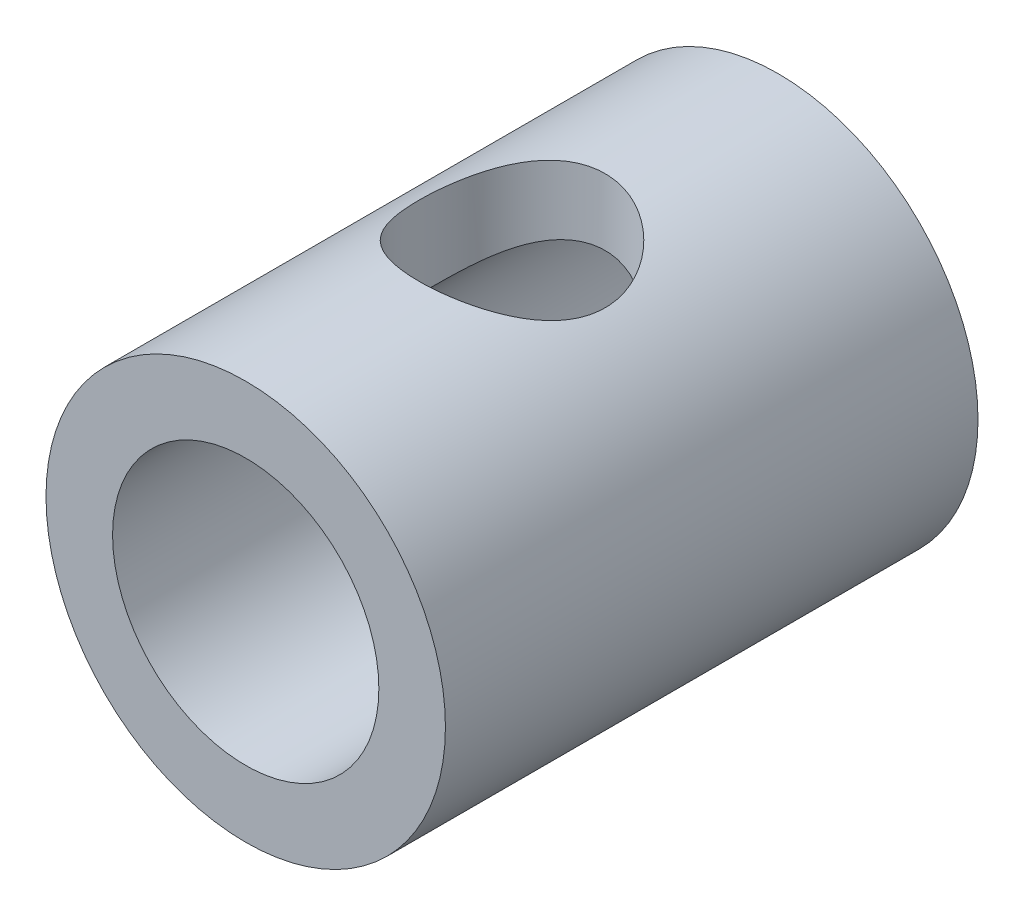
ISO-10303-21;
HEADER;
FILE_DESCRIPTION(('STEP AP214'),'2;1');
FILE_NAME('part.step','',(''),(''),'','','');
FILE_SCHEMA(('AUTOMOTIVE_DESIGN { 1 0 10303 214 1 1 1 1 }'));
ENDSEC;
DATA;
#1=APPLICATION_CONTEXT('core data for automotive mechanical design processes');
#2=APPLICATION_PROTOCOL_DEFINITION('international standard','automotive_design',2000,#1);
#3=PRODUCT_CONTEXT('',#1,'mechanical');
#4=PRODUCT('Part','Part','',(#3));
#5=PRODUCT_RELATED_PRODUCT_CATEGORY('part','',(#4));
#6=PRODUCT_DEFINITION_FORMATION('','',#4);
#7=PRODUCT_DEFINITION_CONTEXT('part definition',#1,'design');
#8=PRODUCT_DEFINITION('design','',#6,#7);
#9=PRODUCT_DEFINITION_SHAPE('','',#8);
#10=(LENGTH_UNIT() NAMED_UNIT(*) SI_UNIT(.MILLI.,.METRE.));
#11=(NAMED_UNIT(*) PLANE_ANGLE_UNIT() SI_UNIT($,.RADIAN.));
#12=(NAMED_UNIT(*) SI_UNIT($,.STERADIAN.) SOLID_ANGLE_UNIT());
#13=UNCERTAINTY_MEASURE_WITH_UNIT(LENGTH_MEASURE(1.E-05),#10,'distance_accuracy_value','');
#14=(GEOMETRIC_REPRESENTATION_CONTEXT(3) GLOBAL_UNCERTAINTY_ASSIGNED_CONTEXT((#13)) GLOBAL_UNIT_ASSIGNED_CONTEXT((#10,
#11,#12)) REPRESENTATION_CONTEXT('',''));
#15=CARTESIAN_POINT('',(0.,0.,0.));
#16=DIRECTION('',(0.,0.,1.));
#17=DIRECTION('',(1.,0.,0.));
#18=AXIS2_PLACEMENT_3D('',#15,#16,#17);
#19=CARTESIAN_POINT('',(0.,0.,40.));
#20=DIRECTION('',(0.,0.,-1.));
#21=DIRECTION('',(-1.,0.,0.));
#22=AXIS2_PLACEMENT_3D('',#19,#20,#21);
#23=CYLINDRICAL_SURFACE('',#22,15.);
#24=CARTESIAN_POINT('',(0.,-15.,27.));
#25=CARTESIAN_POINT('',(0.185527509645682,-14.9999989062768,26.9999987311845));
#26=CARTESIAN_POINT('',(0.37108915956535,-14.9965492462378,26.9926149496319));
#27=CARTESIAN_POINT('',(0.740864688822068,-14.9828363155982,26.963156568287));
#28=CARTESIAN_POINT('',(0.925077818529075,-14.9725695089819,26.9410743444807));
#29=CARTESIAN_POINT('',(1.29101586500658,-14.9454673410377,26.8824175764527));
#30=CARTESIAN_POINT('',(1.47273599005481,-14.928620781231,26.8458183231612));
#31=CARTESIAN_POINT('',(1.8321376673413,-14.8887870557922,26.7585122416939));
#32=CARTESIAN_POINT('',(2.00981753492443,-14.8657973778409,26.7077996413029));
#33=CARTESIAN_POINT('',(2.35915888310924,-14.8143651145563,26.5930291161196));
#34=CARTESIAN_POINT('',(2.53084229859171,-14.7859455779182,26.5290275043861));
#35=CARTESIAN_POINT('',(2.86799253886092,-14.7242659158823,26.3881154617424));
#36=CARTESIAN_POINT('',(3.03345697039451,-14.6910039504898,26.3112001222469));
#37=CARTESIAN_POINT('',(3.35710712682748,-14.6204390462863,26.1451512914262));
#38=CARTESIAN_POINT('',(3.51529725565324,-14.5831385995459,26.0560253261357));
#39=CARTESIAN_POINT('',(3.82374236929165,-14.5053212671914,25.8661597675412));
#40=CARTESIAN_POINT('',(3.97399442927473,-14.4648032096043,25.7654159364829));
#41=CARTESIAN_POINT('',(4.42760170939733,-14.3352174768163,25.4351670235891));
#42=CARTESIAN_POINT('',(4.71623752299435,-14.2420761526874,25.1866208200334));
#43=CARTESIAN_POINT('',(5.24943713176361,-14.0543075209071,24.6462489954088));
#44=CARTESIAN_POINT('',(5.49397191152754,-13.9596792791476,24.3543951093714));
#45=CARTESIAN_POINT('',(5.83075411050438,-13.8209401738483,23.8785879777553));
#46=CARTESIAN_POINT('',(5.94080662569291,-13.7738664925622,23.7078579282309));
#47=CARTESIAN_POINT('',(6.14601851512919,-13.6835306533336,23.3567480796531));
#48=CARTESIAN_POINT('',(6.2411840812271,-13.640266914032,23.1763723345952));
#49=CARTESIAN_POINT('',(6.41576799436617,-13.5590265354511,22.8070684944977));
#50=CARTESIAN_POINT('',(6.4951904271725,-13.5210485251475,22.6181426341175));
#51=CARTESIAN_POINT('',(6.63747055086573,-13.4517751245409,22.2329619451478));
#52=CARTESIAN_POINT('',(6.70032982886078,-13.4204790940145,22.0367078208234));
#53=CARTESIAN_POINT('',(6.80567082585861,-13.3673531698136,21.6494932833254));
#54=CARTESIAN_POINT('',(6.84909352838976,-13.3450926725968,21.4588480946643));
#55=CARTESIAN_POINT('',(6.91991023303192,-13.308509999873,21.0738452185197));
#56=CARTESIAN_POINT('',(6.94730483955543,-13.2941875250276,20.8794876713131));
#57=CARTESIAN_POINT('',(6.98566539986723,-13.2740706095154,20.4888472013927));
#58=CARTESIAN_POINT('',(6.9966423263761,-13.268270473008,20.2925656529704));
#59=CARTESIAN_POINT('',(7.00203713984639,-13.2654245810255,19.8997185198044));
#60=CARTESIAN_POINT('',(6.99645627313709,-13.2683781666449,19.703152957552));
#61=CARTESIAN_POINT('',(6.97022504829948,-13.2821739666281,19.3313397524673));
#62=CARTESIAN_POINT('',(6.95115599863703,-13.2921880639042,19.1559468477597));
#63=CARTESIAN_POINT('',(6.89993033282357,-13.3188511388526,18.8075346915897));
#64=CARTESIAN_POINT('',(6.86776931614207,-13.3355023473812,18.6345162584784));
#65=CARTESIAN_POINT('',(6.79071696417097,-13.3749029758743,18.2920894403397));
#66=CARTESIAN_POINT('',(6.74582796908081,-13.3976512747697,18.1226803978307));
#67=CARTESIAN_POINT('',(6.64374391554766,-13.4485656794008,17.788387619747));
#68=CARTESIAN_POINT('',(6.58654406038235,-13.476733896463,17.6235056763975));
#69=CARTESIAN_POINT('',(6.45890740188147,-13.5383766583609,17.2955287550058));
#70=CARTESIAN_POINT('',(6.38820027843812,-13.5719568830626,17.1325587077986));
#71=CARTESIAN_POINT('',(6.23500689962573,-13.6430140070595,16.8131336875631));
#72=CARTESIAN_POINT('',(6.15251670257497,-13.6804922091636,16.656680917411));
#73=CARTESIAN_POINT('',(5.88811674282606,-13.7973596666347,16.1981069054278));
#74=CARTESIAN_POINT('',(5.68921430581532,-13.8812136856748,15.9066084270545));
#75=CARTESIAN_POINT('',(5.34868196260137,-14.0145878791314,15.4800831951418));
#76=CARTESIAN_POINT('',(5.22097547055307,-14.062774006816,15.333169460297));
#77=CARTESIAN_POINT('',(4.95377039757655,-14.1591066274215,15.0504618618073));
#78=CARTESIAN_POINT('',(4.8142749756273,-14.2072531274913,14.9146650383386));
#79=CARTESIAN_POINT('',(4.52411760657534,-14.3022965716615,14.6548784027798));
#80=CARTESIAN_POINT('',(4.37344759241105,-14.3491925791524,14.5308972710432));
#81=CARTESIAN_POINT('',(4.06185463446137,-14.4404874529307,14.2956665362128));
#82=CARTESIAN_POINT('',(3.90093579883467,-14.4848873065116,14.1844118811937));
#83=CARTESIAN_POINT('',(3.5636444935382,-14.5716107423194,13.9715984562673));
#84=CARTESIAN_POINT('',(3.38692345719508,-14.6138009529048,13.8705365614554));
#85=CARTESIAN_POINT('',(3.02450952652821,-14.6930843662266,13.6838406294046));
#86=CARTESIAN_POINT('',(2.83882065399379,-14.7301798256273,13.5981997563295));
#87=CARTESIAN_POINT('',(2.45973540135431,-14.7982015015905,13.4432006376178));
#88=CARTESIAN_POINT('',(2.26634150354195,-14.8291296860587,13.3738371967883));
#89=CARTESIAN_POINT('',(1.87328306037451,-14.8838894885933,13.2521765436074));
#90=CARTESIAN_POINT('',(1.67361913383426,-14.9077218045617,13.1998776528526));
#91=CARTESIAN_POINT('',(1.2849064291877,-14.9460444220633,13.1162863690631));
#92=CARTESIAN_POINT('',(1.09618911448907,-14.9611026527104,13.0837096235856));
#93=CARTESIAN_POINT('',(0.716291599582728,-14.9840958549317,13.0341106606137));
#94=CARTESIAN_POINT('',(0.525111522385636,-14.9920311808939,13.0170876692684));
#95=CARTESIAN_POINT('',(0.141899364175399,-15.0005528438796,12.9988107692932));
#96=CARTESIAN_POINT('',(-0.0501324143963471,-15.0011416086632,12.9975516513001));
#97=CARTESIAN_POINT('',(-0.433528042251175,-14.9949593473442,13.0108053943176));
#98=CARTESIAN_POINT('',(-0.624891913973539,-14.9881885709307,13.0253177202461));
#99=CARTESIAN_POINT('',(-0.992870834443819,-14.9681629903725,13.0684606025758));
#100=CARTESIAN_POINT('',(-1.16962816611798,-14.9553639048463,13.096099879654));
#101=CARTESIAN_POINT('',(-1.52005950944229,-14.9238191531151,13.1647014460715));
#102=CARTESIAN_POINT('',(-1.69373244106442,-14.9050714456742,13.2056683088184));
#103=CARTESIAN_POINT('',(-2.03675771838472,-14.8620823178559,13.3005018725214));
#104=CARTESIAN_POINT('',(-2.20611137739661,-14.8378425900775,13.3543645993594));
#105=CARTESIAN_POINT('',(-2.53960724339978,-14.7844151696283,13.474524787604));
#106=CARTESIAN_POINT('',(-2.70374743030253,-14.7552255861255,13.5408270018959));
#107=CARTESIAN_POINT('',(-3.03073676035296,-14.6916030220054,13.6874965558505));
#108=CARTESIAN_POINT('',(-3.193396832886,-14.6570381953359,13.7682285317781));
#109=CARTESIAN_POINT('',(-3.51134517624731,-14.584138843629,13.9416764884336));
#110=CARTESIAN_POINT('',(-3.66663071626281,-14.5458029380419,14.0343968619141));
#111=CARTESIAN_POINT('',(-4.12023182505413,-14.4264075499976,14.3295730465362));
#112=CARTESIAN_POINT('',(-4.40646643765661,-14.3409250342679,14.5491227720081));
#113=CARTESIAN_POINT('',(-4.9647193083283,-14.1578733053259,15.0498257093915));
#114=CARTESIAN_POINT('',(-5.23328196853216,-14.0599018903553,15.3346955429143));
#115=CARTESIAN_POINT('',(-5.59821974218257,-13.9167925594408,15.7930755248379));
#116=CARTESIAN_POINT('',(-5.71362151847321,-13.8696962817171,15.9511805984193));
#117=CARTESIAN_POINT('',(-5.93107342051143,-13.7781079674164,16.2770062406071));
#118=CARTESIAN_POINT('',(-6.03312871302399,-13.733614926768,16.4447230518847));
#119=CARTESIAN_POINT('',(-6.22628880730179,-13.6471574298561,16.7946020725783));
#120=CARTESIAN_POINT('',(-6.31692040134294,-13.605325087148,16.9770584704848));
#121=CARTESIAN_POINT('',(-6.48226486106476,-13.5273278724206,17.3501241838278));
#122=CARTESIAN_POINT('',(-6.55698529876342,-13.4911603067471,17.540729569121));
#123=CARTESIAN_POINT('',(-6.68967957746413,-13.4258579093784,17.9287219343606));
#124=CARTESIAN_POINT('',(-6.74766458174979,-13.3967183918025,18.1261042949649));
#125=CARTESIAN_POINT('',(-6.84618962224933,-13.3466383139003,18.5261908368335));
#126=CARTESIAN_POINT('',(-6.88673191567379,-13.3256966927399,18.7288943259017));
#127=CARTESIAN_POINT('',(-6.94693568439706,-13.2944019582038,19.119365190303));
#128=CARTESIAN_POINT('',(-6.96815027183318,-13.2832643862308,19.3068313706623));
#129=CARTESIAN_POINT('',(-6.99536983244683,-13.2689503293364,19.6831655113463));
#130=CARTESIAN_POINT('',(-7.00137576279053,-13.2657733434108,19.8720333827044));
#131=CARTESIAN_POINT('',(-6.99809627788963,-13.2675035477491,20.2495502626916));
#132=CARTESIAN_POINT('',(-6.98881457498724,-13.2724087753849,20.4381993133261));
#133=CARTESIAN_POINT('',(-6.95509456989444,-13.290109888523,20.8137582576));
#134=CARTESIAN_POINT('',(-6.93065662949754,-13.3029055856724,21.0006681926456));
#135=CARTESIAN_POINT('',(-6.8692843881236,-13.3346925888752,21.3576820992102));
#136=CARTESIAN_POINT('',(-6.83339644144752,-13.3531614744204,21.5280143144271));
#137=CARTESIAN_POINT('',(-6.7492425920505,-13.3958930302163,21.8649072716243));
#138=CARTESIAN_POINT('',(-6.70097250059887,-13.4201576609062,22.0314667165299));
#139=CARTESIAN_POINT('',(-6.59251960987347,-13.4737648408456,22.3597822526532));
#140=CARTESIAN_POINT('',(-6.53233858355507,-13.5031066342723,22.5215390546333));
#141=CARTESIAN_POINT('',(-6.40052875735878,-13.566081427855,22.839518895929));
#142=CARTESIAN_POINT('',(-6.32889554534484,-13.5997160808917,22.9957397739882));
#143=CARTESIAN_POINT('',(-6.16962215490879,-13.6727441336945,23.3119684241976));
#144=CARTESIAN_POINT('',(-6.0812384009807,-13.7123709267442,23.4715478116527));
#145=CARTESIAN_POINT('',(-5.89263773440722,-13.7944698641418,23.7828501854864));
#146=CARTESIAN_POINT('',(-5.7924167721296,-13.8369429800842,23.9345704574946));
#147=CARTESIAN_POINT('',(-5.58073172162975,-13.9236674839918,24.2294661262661));
#148=CARTESIAN_POINT('',(-5.46926511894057,-13.9679192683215,24.3726396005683));
#149=CARTESIAN_POINT('',(-5.23568066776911,-14.0571433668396,24.6497844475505));
#150=CARTESIAN_POINT('',(-5.11356215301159,-14.1021157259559,24.7837552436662));
#151=CARTESIAN_POINT('',(-4.84643680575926,-14.1962694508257,25.0548804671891));
#152=CARTESIAN_POINT('',(-4.7003634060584,-14.2454187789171,25.1909977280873));
#153=CARTESIAN_POINT('',(-4.3968457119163,-14.3420047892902,25.4504676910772));
#154=CARTESIAN_POINT('',(-4.23940499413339,-14.3894420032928,25.5738243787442));
#155=CARTESIAN_POINT('',(-3.91380631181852,-14.4813935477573,25.8070870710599));
#156=CARTESIAN_POINT('',(-3.74563849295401,-14.525905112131,25.916980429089));
#157=CARTESIAN_POINT('',(-3.39976003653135,-14.6107261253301,26.1222587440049));
#158=CARTESIAN_POINT('',(-3.22205385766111,-14.6510375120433,26.2176504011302));
#159=CARTESIAN_POINT('',(-2.85900975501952,-14.7261758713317,26.3926892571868));
#160=CARTESIAN_POINT('',(-2.67371235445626,-14.7610281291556,26.4724095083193));
#161=CARTESIAN_POINT('',(-2.29606194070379,-14.8244639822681,26.615804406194));
#162=CARTESIAN_POINT('',(-2.1037124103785,-14.853050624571,26.6794868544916));
#163=CARTESIAN_POINT('',(-1.71380885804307,-14.9030669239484,26.7899797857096));
#164=CARTESIAN_POINT('',(-1.51626804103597,-14.9245131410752,26.8368293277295));
#165=CARTESIAN_POINT('',(-1.11729196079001,-14.9596693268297,26.9132383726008));
#166=CARTESIAN_POINT('',(-0.915859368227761,-14.9733844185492,26.9428093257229));
#167=CARTESIAN_POINT('',(-0.594975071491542,-14.9886652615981,26.9756855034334));
#168=CARTESIAN_POINT('',(-0.476212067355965,-14.9929110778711,26.9847985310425));
#169=CARTESIAN_POINT('',(-0.238304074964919,-14.9985788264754,26.9969562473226));
#170=CARTESIAN_POINT('',(-0.119159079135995,-15.0000007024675,27.0000008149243));
#171=CARTESIAN_POINT('',(0.,-15.,27.));
#172=B_SPLINE_CURVE_WITH_KNOTS('',3,(#24,#25,#26,#27,#28,#29,#30,#31,#32,#33,#34,#35,#36,#37,
#38,#39,#40,#41,#42,#43,#44,#45,#46,#47,#48,#49,#50,#51,#52,#53,#54,#55,#56,#57,#58,#59,#60,#61,
#62,#63,#64,#65,#66,#67,#68,#69,#70,#71,#72,#73,#74,#75,#76,#77,#78,#79,#80,#81,#82,#83,#84,#85,
#86,#87,#88,#89,#90,#91,#92,#93,#94,#95,#96,#97,#98,#99,#100,#101,#102,#103,#104,#105,#106,#107,
#108,#109,#110,#111,#112,#113,#114,#115,#116,#117,#118,#119,#120,#121,#122,#123,#124,#125,#126,
#127,#128,#129,#130,#131,#132,#133,#134,#135,#136,#137,#138,#139,#140,#141,#142,#143,#144,#145,
#146,#147,#148,#149,#150,#151,#152,#153,#154,#155,#156,#157,#158,#159,#160,#161,#162,#163,#164,
#165,#166,#167,#168,#169,#170,#171),.UNSPECIFIED.,.T.,.F.,(4,2,2,2,2,2,2,2,2,2,2,2,2,2,2,2,2,2,
2,2,2,2,2,2,2,2,2,2,2,2,2,2,2,2,2,2,2,2,2,2,2,2,2,2,2,2,2,2,2,2,2,2,2,2,2,2,2,2,2,2,2,2,2,2,2,2,
2,2,2,2,2,2,2,4),(0.,0.556463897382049,1.11321665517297,1.67092114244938,2.22885406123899,
2.78446926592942,3.34029614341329,3.89578196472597,4.45147105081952,5.62255040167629,
6.7943974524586,7.41925763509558,8.04385722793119,8.66829450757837,9.29267193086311,
9.88222605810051,10.4717579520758,11.0608956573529,11.6499890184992,12.1794981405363,
12.7091853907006,13.2387753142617,13.7685719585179,14.3103609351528,14.8523315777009,
15.9357488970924,16.5368462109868,17.1377829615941,17.7391578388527,18.3402931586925,
18.9631926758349,19.5858153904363,20.2082391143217,20.8306016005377,21.4061427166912,
21.9816551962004,22.556977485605,23.132280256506,23.6697472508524,24.2073988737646,
24.7448850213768,25.2825769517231,25.8365253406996,26.390677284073,27.4984032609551,
28.7034024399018,29.3068236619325,29.9100105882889,30.5331266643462,31.1559455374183,
31.7783479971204,32.4006698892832,32.9668805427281,33.5330555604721,34.0990931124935,
34.6651171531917,35.189684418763,35.7144293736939,36.2390962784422,36.763965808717,
37.3234087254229,37.8830435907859,38.4428038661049,39.0025991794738,39.6187477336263,
40.2347032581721,40.8512330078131,41.4674770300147,42.0807765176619,42.6937770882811,
43.3053459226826,43.9165090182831,44.2739029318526,44.6313039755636),.UNSPECIFIED.);
#173=CARTESIAN_POINT('',(0.,-15.,27.));
#174=VERTEX_POINT('',#173);
#175=EDGE_CURVE('E72',#174,#174,#172,.T.);
#176=ORIENTED_EDGE('',*,*,#175,.T.);
#177=EDGE_LOOP('',(#176));
#178=FACE_BOUND('',#177,.T.);
#179=CARTESIAN_POINT('',(0.,15.,27.));
#180=CARTESIAN_POINT('',(-0.185527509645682,14.9999989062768,26.9999987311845));
#181=CARTESIAN_POINT('',(-0.37108915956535,14.9965492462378,26.9926149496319));
#182=CARTESIAN_POINT('',(-0.740864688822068,14.9828363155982,26.963156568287));
#183=CARTESIAN_POINT('',(-0.925077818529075,14.9725695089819,26.9410743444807));
#184=CARTESIAN_POINT('',(-1.29101586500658,14.9454673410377,26.8824175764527));
#185=CARTESIAN_POINT('',(-1.47273599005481,14.928620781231,26.8458183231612));
#186=CARTESIAN_POINT('',(-1.8321376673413,14.8887870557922,26.7585122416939));
#187=CARTESIAN_POINT('',(-2.00981753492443,14.8657973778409,26.7077996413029));
#188=CARTESIAN_POINT('',(-2.35915888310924,14.8143651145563,26.5930291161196));
#189=CARTESIAN_POINT('',(-2.53084229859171,14.7859455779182,26.5290275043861));
#190=CARTESIAN_POINT('',(-2.86799253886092,14.7242659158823,26.3881154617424));
#191=CARTESIAN_POINT('',(-3.03345697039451,14.6910039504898,26.3112001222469));
#192=CARTESIAN_POINT('',(-3.35710712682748,14.6204390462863,26.1451512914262));
#193=CARTESIAN_POINT('',(-3.51529725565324,14.5831385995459,26.0560253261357));
#194=CARTESIAN_POINT('',(-3.82374236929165,14.5053212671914,25.8661597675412));
#195=CARTESIAN_POINT('',(-3.97399442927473,14.4648032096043,25.7654159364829));
#196=CARTESIAN_POINT('',(-4.42760170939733,14.3352174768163,25.4351670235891));
#197=CARTESIAN_POINT('',(-4.71623752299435,14.2420761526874,25.1866208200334));
#198=CARTESIAN_POINT('',(-5.24943713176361,14.0543075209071,24.6462489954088));
#199=CARTESIAN_POINT('',(-5.49397191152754,13.9596792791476,24.3543951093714));
#200=CARTESIAN_POINT('',(-5.83075411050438,13.8209401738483,23.8785879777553));
#201=CARTESIAN_POINT('',(-5.94080662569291,13.7738664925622,23.7078579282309));
#202=CARTESIAN_POINT('',(-6.14601851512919,13.6835306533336,23.3567480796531));
#203=CARTESIAN_POINT('',(-6.2411840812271,13.640266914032,23.1763723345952));
#204=CARTESIAN_POINT('',(-6.41576799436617,13.5590265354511,22.8070684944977));
#205=CARTESIAN_POINT('',(-6.4951904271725,13.5210485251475,22.6181426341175));
#206=CARTESIAN_POINT('',(-6.63747055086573,13.4517751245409,22.2329619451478));
#207=CARTESIAN_POINT('',(-6.70032982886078,13.4204790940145,22.0367078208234));
#208=CARTESIAN_POINT('',(-6.80567082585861,13.3673531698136,21.6494932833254));
#209=CARTESIAN_POINT('',(-6.84909352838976,13.3450926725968,21.4588480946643));
#210=CARTESIAN_POINT('',(-6.91991023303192,13.308509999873,21.0738452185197));
#211=CARTESIAN_POINT('',(-6.94730483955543,13.2941875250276,20.8794876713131));
#212=CARTESIAN_POINT('',(-6.98566539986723,13.2740706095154,20.4888472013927));
#213=CARTESIAN_POINT('',(-6.9966423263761,13.268270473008,20.2925656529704));
#214=CARTESIAN_POINT('',(-7.00203713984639,13.2654245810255,19.8997185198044));
#215=CARTESIAN_POINT('',(-6.99645627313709,13.2683781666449,19.703152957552));
#216=CARTESIAN_POINT('',(-6.97022504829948,13.2821739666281,19.3313397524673));
#217=CARTESIAN_POINT('',(-6.95115599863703,13.2921880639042,19.1559468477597));
#218=CARTESIAN_POINT('',(-6.89993033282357,13.3188511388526,18.8075346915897));
#219=CARTESIAN_POINT('',(-6.86776931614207,13.3355023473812,18.6345162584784));
#220=CARTESIAN_POINT('',(-6.79071696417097,13.3749029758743,18.2920894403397));
#221=CARTESIAN_POINT('',(-6.74582796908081,13.3976512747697,18.1226803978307));
#222=CARTESIAN_POINT('',(-6.64374391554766,13.4485656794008,17.788387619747));
#223=CARTESIAN_POINT('',(-6.58654406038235,13.476733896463,17.6235056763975));
#224=CARTESIAN_POINT('',(-6.45890740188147,13.5383766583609,17.2955287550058));
#225=CARTESIAN_POINT('',(-6.38820027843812,13.5719568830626,17.1325587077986));
#226=CARTESIAN_POINT('',(-6.23500689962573,13.6430140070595,16.8131336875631));
#227=CARTESIAN_POINT('',(-6.15251670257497,13.6804922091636,16.656680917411));
#228=CARTESIAN_POINT('',(-5.88811674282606,13.7973596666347,16.1981069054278));
#229=CARTESIAN_POINT('',(-5.68921430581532,13.8812136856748,15.9066084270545));
#230=CARTESIAN_POINT('',(-5.34868196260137,14.0145878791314,15.4800831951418));
#231=CARTESIAN_POINT('',(-5.22097547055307,14.062774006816,15.333169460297));
#232=CARTESIAN_POINT('',(-4.95377039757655,14.1591066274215,15.0504618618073));
#233=CARTESIAN_POINT('',(-4.8142749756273,14.2072531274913,14.9146650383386));
#234=CARTESIAN_POINT('',(-4.52411760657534,14.3022965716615,14.6548784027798));
#235=CARTESIAN_POINT('',(-4.37344759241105,14.3491925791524,14.5308972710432));
#236=CARTESIAN_POINT('',(-4.06185463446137,14.4404874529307,14.2956665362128));
#237=CARTESIAN_POINT('',(-3.90093579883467,14.4848873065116,14.1844118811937));
#238=CARTESIAN_POINT('',(-3.5636444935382,14.5716107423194,13.9715984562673));
#239=CARTESIAN_POINT('',(-3.38692345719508,14.6138009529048,13.8705365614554));
#240=CARTESIAN_POINT('',(-3.02450952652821,14.6930843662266,13.6838406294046));
#241=CARTESIAN_POINT('',(-2.83882065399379,14.7301798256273,13.5981997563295));
#242=CARTESIAN_POINT('',(-2.45973540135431,14.7982015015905,13.4432006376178));
#243=CARTESIAN_POINT('',(-2.26634150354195,14.8291296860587,13.3738371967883));
#244=CARTESIAN_POINT('',(-1.87328306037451,14.8838894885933,13.2521765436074));
#245=CARTESIAN_POINT('',(-1.67361913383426,14.9077218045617,13.1998776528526));
#246=CARTESIAN_POINT('',(-1.2849064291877,14.9460444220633,13.1162863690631));
#247=CARTESIAN_POINT('',(-1.09618911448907,14.9611026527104,13.0837096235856));
#248=CARTESIAN_POINT('',(-0.716291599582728,14.9840958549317,13.0341106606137));
#249=CARTESIAN_POINT('',(-0.525111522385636,14.9920311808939,13.0170876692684));
#250=CARTESIAN_POINT('',(-0.141899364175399,15.0005528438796,12.9988107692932));
#251=CARTESIAN_POINT('',(0.0501324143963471,15.0011416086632,12.9975516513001));
#252=CARTESIAN_POINT('',(0.433528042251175,14.9949593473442,13.0108053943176));
#253=CARTESIAN_POINT('',(0.624891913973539,14.9881885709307,13.0253177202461));
#254=CARTESIAN_POINT('',(0.992870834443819,14.9681629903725,13.0684606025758));
#255=CARTESIAN_POINT('',(1.16962816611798,14.9553639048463,13.096099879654));
#256=CARTESIAN_POINT('',(1.52005950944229,14.9238191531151,13.1647014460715));
#257=CARTESIAN_POINT('',(1.69373244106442,14.9050714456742,13.2056683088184));
#258=CARTESIAN_POINT('',(2.03675771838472,14.8620823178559,13.3005018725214));
#259=CARTESIAN_POINT('',(2.20611137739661,14.8378425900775,13.3543645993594));
#260=CARTESIAN_POINT('',(2.53960724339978,14.7844151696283,13.474524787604));
#261=CARTESIAN_POINT('',(2.70374743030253,14.7552255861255,13.5408270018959));
#262=CARTESIAN_POINT('',(3.03073676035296,14.6916030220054,13.6874965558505));
#263=CARTESIAN_POINT('',(3.193396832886,14.6570381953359,13.7682285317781));
#264=CARTESIAN_POINT('',(3.51134517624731,14.584138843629,13.9416764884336));
#265=CARTESIAN_POINT('',(3.66663071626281,14.5458029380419,14.0343968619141));
#266=CARTESIAN_POINT('',(4.12023182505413,14.4264075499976,14.3295730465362));
#267=CARTESIAN_POINT('',(4.40646643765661,14.3409250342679,14.5491227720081));
#268=CARTESIAN_POINT('',(4.9647193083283,14.1578733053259,15.0498257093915));
#269=CARTESIAN_POINT('',(5.23328196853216,14.0599018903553,15.3346955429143));
#270=CARTESIAN_POINT('',(5.59821974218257,13.9167925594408,15.7930755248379));
#271=CARTESIAN_POINT('',(5.71362151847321,13.8696962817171,15.9511805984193));
#272=CARTESIAN_POINT('',(5.93107342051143,13.7781079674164,16.2770062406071));
#273=CARTESIAN_POINT('',(6.03312871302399,13.733614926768,16.4447230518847));
#274=CARTESIAN_POINT('',(6.22628880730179,13.6471574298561,16.7946020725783));
#275=CARTESIAN_POINT('',(6.31692040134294,13.605325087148,16.9770584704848));
#276=CARTESIAN_POINT('',(6.48226486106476,13.5273278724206,17.3501241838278));
#277=CARTESIAN_POINT('',(6.55698529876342,13.4911603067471,17.540729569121));
#278=CARTESIAN_POINT('',(6.68967957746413,13.4258579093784,17.9287219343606));
#279=CARTESIAN_POINT('',(6.74766458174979,13.3967183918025,18.1261042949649));
#280=CARTESIAN_POINT('',(6.84618962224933,13.3466383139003,18.5261908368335));
#281=CARTESIAN_POINT('',(6.88673191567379,13.3256966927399,18.7288943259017));
#282=CARTESIAN_POINT('',(6.94693568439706,13.2944019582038,19.119365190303));
#283=CARTESIAN_POINT('',(6.96815027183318,13.2832643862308,19.3068313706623));
#284=CARTESIAN_POINT('',(6.99536983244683,13.2689503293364,19.6831655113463));
#285=CARTESIAN_POINT('',(7.00137576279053,13.2657733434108,19.8720333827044));
#286=CARTESIAN_POINT('',(6.99809627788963,13.2675035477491,20.2495502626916));
#287=CARTESIAN_POINT('',(6.98881457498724,13.2724087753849,20.4381993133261));
#288=CARTESIAN_POINT('',(6.95509456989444,13.290109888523,20.8137582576));
#289=CARTESIAN_POINT('',(6.93065662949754,13.3029055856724,21.0006681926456));
#290=CARTESIAN_POINT('',(6.8692843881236,13.3346925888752,21.3576820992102));
#291=CARTESIAN_POINT('',(6.83339644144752,13.3531614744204,21.5280143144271));
#292=CARTESIAN_POINT('',(6.7492425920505,13.3958930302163,21.8649072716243));
#293=CARTESIAN_POINT('',(6.70097250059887,13.4201576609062,22.0314667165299));
#294=CARTESIAN_POINT('',(6.59251960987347,13.4737648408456,22.3597822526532));
#295=CARTESIAN_POINT('',(6.53233858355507,13.5031066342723,22.5215390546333));
#296=CARTESIAN_POINT('',(6.40052875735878,13.566081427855,22.839518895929));
#297=CARTESIAN_POINT('',(6.32889554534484,13.5997160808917,22.9957397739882));
#298=CARTESIAN_POINT('',(6.16962215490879,13.6727441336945,23.3119684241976));
#299=CARTESIAN_POINT('',(6.0812384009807,13.7123709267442,23.4715478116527));
#300=CARTESIAN_POINT('',(5.89263773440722,13.7944698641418,23.7828501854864));
#301=CARTESIAN_POINT('',(5.7924167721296,13.8369429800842,23.9345704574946));
#302=CARTESIAN_POINT('',(5.58073172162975,13.9236674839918,24.2294661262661));
#303=CARTESIAN_POINT('',(5.46926511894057,13.9679192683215,24.3726396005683));
#304=CARTESIAN_POINT('',(5.23568066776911,14.0571433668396,24.6497844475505));
#305=CARTESIAN_POINT('',(5.11356215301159,14.1021157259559,24.7837552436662));
#306=CARTESIAN_POINT('',(4.84643680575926,14.1962694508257,25.0548804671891));
#307=CARTESIAN_POINT('',(4.7003634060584,14.2454187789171,25.1909977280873));
#308=CARTESIAN_POINT('',(4.3968457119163,14.3420047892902,25.4504676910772));
#309=CARTESIAN_POINT('',(4.23940499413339,14.3894420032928,25.5738243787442));
#310=CARTESIAN_POINT('',(3.91380631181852,14.4813935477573,25.8070870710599));
#311=CARTESIAN_POINT('',(3.74563849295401,14.525905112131,25.916980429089));
#312=CARTESIAN_POINT('',(3.39976003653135,14.6107261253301,26.1222587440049));
#313=CARTESIAN_POINT('',(3.22205385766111,14.6510375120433,26.2176504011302));
#314=CARTESIAN_POINT('',(2.85900975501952,14.7261758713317,26.3926892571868));
#315=CARTESIAN_POINT('',(2.67371235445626,14.7610281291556,26.4724095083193));
#316=CARTESIAN_POINT('',(2.29606194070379,14.8244639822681,26.615804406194));
#317=CARTESIAN_POINT('',(2.1037124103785,14.853050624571,26.6794868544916));
#318=CARTESIAN_POINT('',(1.71380885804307,14.9030669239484,26.7899797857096));
#319=CARTESIAN_POINT('',(1.51626804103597,14.9245131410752,26.8368293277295));
#320=CARTESIAN_POINT('',(1.11729196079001,14.9596693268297,26.9132383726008));
#321=CARTESIAN_POINT('',(0.915859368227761,14.9733844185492,26.9428093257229));
#322=CARTESIAN_POINT('',(0.594975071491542,14.9886652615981,26.9756855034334));
#323=CARTESIAN_POINT('',(0.476212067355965,14.9929110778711,26.9847985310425));
#324=CARTESIAN_POINT('',(0.238304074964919,14.9985788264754,26.9969562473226));
#325=CARTESIAN_POINT('',(0.119159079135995,15.0000007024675,27.0000008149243));
#326=CARTESIAN_POINT('',(0.,15.,27.));
#327=B_SPLINE_CURVE_WITH_KNOTS('',3,(#179,#180,#181,#182,#183,#184,#185,#186,#187,#188,#189,
#190,#191,#192,#193,#194,#195,#196,#197,#198,#199,#200,#201,#202,#203,#204,#205,#206,#207,#208,
#209,#210,#211,#212,#213,#214,#215,#216,#217,#218,#219,#220,#221,#222,#223,#224,#225,#226,#227,
#228,#229,#230,#231,#232,#233,#234,#235,#236,#237,#238,#239,#240,#241,#242,#243,#244,#245,#246,
#247,#248,#249,#250,#251,#252,#253,#254,#255,#256,#257,#258,#259,#260,#261,#262,#263,#264,#265,
#266,#267,#268,#269,#270,#271,#272,#273,#274,#275,#276,#277,#278,#279,#280,#281,#282,#283,#284,
#285,#286,#287,#288,#289,#290,#291,#292,#293,#294,#295,#296,#297,#298,#299,#300,#301,#302,#303,
#304,#305,#306,#307,#308,#309,#310,#311,#312,#313,#314,#315,#316,#317,#318,#319,#320,#321,#322,
#323,#324,#325,#326),.UNSPECIFIED.,.T.,.F.,(4,2,2,2,2,2,2,2,2,2,2,2,2,2,2,2,2,2,2,2,2,2,2,2,2,2,
2,2,2,2,2,2,2,2,2,2,2,2,2,2,2,2,2,2,2,2,2,2,2,2,2,2,2,2,2,2,2,2,2,2,2,2,2,2,2,2,2,2,2,2,2,2,2,
4),(0.,0.556463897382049,1.11321665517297,1.67092114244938,2.22885406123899,2.78446926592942,
3.34029614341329,3.89578196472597,4.45147105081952,5.62255040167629,6.7943974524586,
7.41925763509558,8.04385722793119,8.66829450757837,9.29267193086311,9.88222605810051,
10.4717579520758,11.0608956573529,11.6499890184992,12.1794981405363,12.7091853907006,
13.2387753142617,13.7685719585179,14.3103609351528,14.8523315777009,15.9357488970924,
16.5368462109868,17.1377829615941,17.7391578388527,18.3402931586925,18.9631926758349,
19.5858153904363,20.2082391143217,20.8306016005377,21.4061427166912,21.9816551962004,
22.556977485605,23.132280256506,23.6697472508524,24.2073988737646,24.7448850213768,
25.2825769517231,25.8365253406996,26.390677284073,27.4984032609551,28.7034024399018,
29.3068236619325,29.9100105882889,30.5331266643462,31.1559455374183,31.7783479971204,
32.4006698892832,32.9668805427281,33.5330555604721,34.0990931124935,34.6651171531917,
35.189684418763,35.7144293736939,36.2390962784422,36.763965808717,37.3234087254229,
37.8830435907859,38.4428038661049,39.0025991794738,39.6187477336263,40.2347032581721,
40.8512330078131,41.4674770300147,42.0807765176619,42.6937770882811,43.3053459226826,
43.9165090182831,44.2739029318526,44.6313039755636),.UNSPECIFIED.);
#328=CARTESIAN_POINT('',(0.,15.,27.));
#329=VERTEX_POINT('',#328);
#330=EDGE_CURVE('E68',#329,#329,#327,.T.);
#331=ORIENTED_EDGE('',*,*,#330,.T.);
#332=EDGE_LOOP('',(#331));
#333=FACE_BOUND('',#332,.T.);
#334=CARTESIAN_POINT('',(0.,0.,40.));
#335=DIRECTION('',(0.,0.,1.));
#336=DIRECTION('',(1.,0.,0.));
#337=AXIS2_PLACEMENT_3D('',#334,#335,#336);
#338=CIRCLE('',#337,15.);
#339=CARTESIAN_POINT('',(15.,0.,40.));
#340=VERTEX_POINT('',#339);
#341=EDGE_CURVE('E10',#340,#340,#338,.T.);
#342=ORIENTED_EDGE('',*,*,#341,.F.);
#343=EDGE_LOOP('',(#342));
#344=FACE_BOUND('',#343,.T.);
#345=CARTESIAN_POINT('',(0.,0.,0.));
#346=DIRECTION('',(0.,0.,1.));
#347=DIRECTION('',(1.,0.,0.));
#348=AXIS2_PLACEMENT_3D('',#345,#346,#347);
#349=CIRCLE('',#348,15.);
#350=CARTESIAN_POINT('',(15.,0.,0.));
#351=VERTEX_POINT('',#350);
#352=EDGE_CURVE('E41',#351,#351,#349,.T.);
#353=ORIENTED_EDGE('',*,*,#352,.T.);
#354=EDGE_LOOP('',(#353));
#355=FACE_BOUND('',#354,.T.);
#356=ADVANCED_FACE('F29',(#178,#333,#344,#355),#23,.T.);
#357=CARTESIAN_POINT('',(0.,0.,40.));
#358=DIRECTION('',(0.,0.,1.));
#359=DIRECTION('',(1.,0.,0.));
#360=AXIS2_PLACEMENT_3D('',#357,#358,#359);
#361=PLANE('',#360);
#362=CARTESIAN_POINT('',(0.,0.,40.));
#363=DIRECTION('',(0.,0.,1.));
#364=DIRECTION('',(1.,0.,0.));
#365=AXIS2_PLACEMENT_3D('',#362,#363,#364);
#366=CIRCLE('',#365,10.);
#367=CARTESIAN_POINT('',(10.,0.,40.));
#368=VERTEX_POINT('',#367);
#369=EDGE_CURVE('E49',#368,#368,#366,.T.);
#370=ORIENTED_EDGE('',*,*,#369,.F.);
#371=EDGE_LOOP('',(#370));
#372=FACE_BOUND('',#371,.T.);
#373=ORIENTED_EDGE('',*,*,#341,.T.);
#374=EDGE_LOOP('',(#373));
#375=FACE_BOUND('',#374,.T.);
#376=ADVANCED_FACE('F83',(#372,#375),#361,.T.);
#377=CARTESIAN_POINT('',(0.,0.,0.));
#378=DIRECTION('',(0.,0.,1.));
#379=DIRECTION('',(1.,0.,0.));
#380=AXIS2_PLACEMENT_3D('',#377,#378,#379);
#381=PLANE('',#380);
#382=CARTESIAN_POINT('',(0.,0.,0.));
#383=DIRECTION('',(0.,0.,1.));
#384=DIRECTION('',(1.,0.,0.));
#385=AXIS2_PLACEMENT_3D('',#382,#383,#384);
#386=CIRCLE('',#385,10.);
#387=CARTESIAN_POINT('',(10.,0.,0.));
#388=VERTEX_POINT('',#387);
#389=EDGE_CURVE('E46',#388,#388,#386,.T.);
#390=ORIENTED_EDGE('',*,*,#389,.T.);
#391=EDGE_LOOP('',(#390));
#392=FACE_BOUND('',#391,.T.);
#393=ORIENTED_EDGE('',*,*,#352,.F.);
#394=EDGE_LOOP('',(#393));
#395=FACE_BOUND('',#394,.T.);
#396=ADVANCED_FACE('F85',(#392,#395),#381,.F.);
#397=CARTESIAN_POINT('',(0.,0.,0.));
#398=DIRECTION('',(0.,0.,1.));
#399=DIRECTION('',(1.,0.,0.));
#400=AXIS2_PLACEMENT_3D('',#397,#398,#399);
#401=CYLINDRICAL_SURFACE('',#400,10.);
#402=CARTESIAN_POINT('',(0.,-10.,27.));
#403=CARTESIAN_POINT('',(-0.174046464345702,-10.0000009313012,27.0000009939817));
#404=CARTESIAN_POINT('',(-0.348081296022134,-9.99544723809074,26.9935005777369));
#405=CARTESIAN_POINT('',(-0.694704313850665,-9.97734921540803,26.967609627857));
#406=CARTESIAN_POINT('',(-0.867292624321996,-9.96380566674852,26.9482202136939));
#407=CARTESIAN_POINT('',(-1.20970785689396,-9.92805369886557,26.8968536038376));
#408=CARTESIAN_POINT('',(-1.37953410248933,-9.90584318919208,26.8648733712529));
#409=CARTESIAN_POINT('',(-1.7151575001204,-9.85327834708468,26.7888031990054));
#410=CARTESIAN_POINT('',(-1.88095451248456,-9.822923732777,26.7447128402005));
#411=CARTESIAN_POINT('',(-2.2066220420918,-9.75491370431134,26.6452729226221));
#412=CARTESIAN_POINT('',(-2.36651866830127,-9.71729666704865,26.5899824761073));
#413=CARTESIAN_POINT('',(-2.68045503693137,-9.6354306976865,26.4686566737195));
#414=CARTESIAN_POINT('',(-2.83449245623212,-9.59117916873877,26.4026171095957));
#415=CARTESIAN_POINT('',(-3.2866126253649,-9.44974380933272,26.1894301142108));
#416=CARTESIAN_POINT('',(-3.5749841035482,-9.34381834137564,26.0271271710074));
#417=CARTESIAN_POINT('',(-4.14570734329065,-9.10588750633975,25.651562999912));
#418=CARTESIAN_POINT('',(-4.42527784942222,-8.97240500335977,25.435067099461));
#419=CARTESIAN_POINT('',(-4.94680356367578,-8.69576099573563,24.9651295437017));
#420=CARTESIAN_POINT('',(-5.18870133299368,-8.55258517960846,24.7116325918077));
#421=CARTESIAN_POINT('',(-5.5408637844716,-8.326042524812,24.2826502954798));
#422=CARTESIAN_POINT('',(-5.66433193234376,-8.24231068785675,24.1179931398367));
#423=CARTESIAN_POINT('',(-5.89691627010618,-8.0775404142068,23.7774194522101));
#424=CARTESIAN_POINT('',(-6.00602873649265,-7.99650268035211,23.6015000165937));
#425=CARTESIAN_POINT('',(-6.20896467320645,-7.83997218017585,23.2391093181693));
#426=CARTESIAN_POINT('',(-6.30281172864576,-7.76447096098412,23.0526549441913));
#427=CARTESIAN_POINT('',(-6.4744747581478,-7.62191750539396,22.6693158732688));
#428=CARTESIAN_POINT('',(-6.55229087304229,-7.55486519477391,22.4724312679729));
#429=CARTESIAN_POINT('',(-6.66903276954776,-7.45171408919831,22.1320245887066));
#430=CARTESIAN_POINT('',(-6.71251962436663,-7.41248243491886,21.9910029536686));
#431=CARTESIAN_POINT('',(-6.79082449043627,-7.34081203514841,21.7048998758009));
#432=CARTESIAN_POINT('',(-6.82564508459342,-7.30837126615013,21.5598196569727));
#433=CARTESIAN_POINT('',(-6.88610635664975,-7.25143204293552,21.2664627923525));
#434=CARTESIAN_POINT('',(-6.91176179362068,-7.22692082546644,21.118191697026));
#435=CARTESIAN_POINT('',(-6.95354913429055,-7.18672385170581,20.8191138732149));
#436=CARTESIAN_POINT('',(-6.96968105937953,-7.17103807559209,20.6683071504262));
#437=CARTESIAN_POINT('',(-6.99217933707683,-7.14910348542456,20.3643859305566));
#438=CARTESIAN_POINT('',(-6.99848832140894,-7.14291011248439,20.21126311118));
#439=CARTESIAN_POINT('',(-7.00103012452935,-7.14041874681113,19.9048544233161));
#440=CARTESIAN_POINT('',(-6.99726298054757,-7.14412071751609,19.7515685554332));
#441=CARTESIAN_POINT('',(-6.97972342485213,-7.16125767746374,19.4460281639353));
#442=CARTESIAN_POINT('',(-6.96594504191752,-7.17469847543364,19.2937743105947));
#443=CARTESIAN_POINT('',(-6.92865962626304,-7.21070944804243,18.9915942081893));
#444=CARTESIAN_POINT('',(-6.90515239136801,-7.2332798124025,18.8416680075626));
#445=CARTESIAN_POINT('',(-6.82436103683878,-7.309816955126,18.4165355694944));
#446=CARTESIAN_POINT('',(-6.75545644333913,-7.37404523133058,18.1452926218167));
#447=CARTESIAN_POINT('',(-6.58820457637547,-7.52383080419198,17.6183515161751));
#448=CARTESIAN_POINT('',(-6.48983369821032,-7.60940519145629,17.3626660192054));
#449=CARTESIAN_POINT('',(-6.29267017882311,-7.77268614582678,16.9266736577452));
#450=CARTESIAN_POINT('',(-6.19938304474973,-7.84753392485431,16.7427480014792));
#451=CARTESIAN_POINT('',(-5.99805241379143,-8.00246822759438,16.3853841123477));
#452=CARTESIAN_POINT('',(-5.89000288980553,-8.08255688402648,16.2119502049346));
#453=CARTESIAN_POINT('',(-5.65965729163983,-8.24549718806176,15.8756955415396));
#454=CARTESIAN_POINT('',(-5.53733600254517,-8.32835353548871,15.7128943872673));
#455=CARTESIAN_POINT('',(-5.27911187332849,-8.49438272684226,15.3986605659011));
#456=CARTESIAN_POINT('',(-5.14321077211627,-8.57755552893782,15.2472264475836));
#457=CARTESIAN_POINT('',(-4.85650052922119,-8.74311933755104,14.9545196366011));
#458=CARTESIAN_POINT('',(-4.70553198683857,-8.82548896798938,14.8133907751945));
#459=CARTESIAN_POINT('',(-4.39047411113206,-8.98637991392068,14.5441154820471));
#460=CARTESIAN_POINT('',(-4.22638355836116,-9.06490087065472,14.4159702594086));
#461=CARTESIAN_POINT('',(-3.88592051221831,-9.21597774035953,14.1739235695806));
#462=CARTESIAN_POINT('',(-3.70957067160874,-9.28854414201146,14.0599968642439));
#463=CARTESIAN_POINT('',(-3.34508447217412,-9.42593797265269,13.8473673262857));
#464=CARTESIAN_POINT('',(-3.15695165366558,-9.49076770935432,13.7486599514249));
#465=CARTESIAN_POINT('',(-2.8127664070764,-9.59756542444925,13.5878219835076));
#466=CARTESIAN_POINT('',(-2.65881551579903,-9.64141919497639,13.522429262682));
#467=CARTESIAN_POINT('',(-2.34510246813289,-9.72248549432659,13.4023726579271));
#468=CARTESIAN_POINT('',(-2.18534149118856,-9.75969936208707,13.3477066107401));
#469=CARTESIAN_POINT('',(-1.86092321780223,-9.82671791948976,13.2497659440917));
#470=CARTESIAN_POINT('',(-1.69626825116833,-9.85652607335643,13.2064859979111));
#471=CARTESIAN_POINT('',(-1.36302442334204,-9.90810719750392,13.1318622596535));
#472=CARTESIAN_POINT('',(-1.19443548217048,-9.92988000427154,13.1005187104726));
#473=CARTESIAN_POINT('',(-0.853835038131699,-9.9649582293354,13.050127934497));
#474=CARTESIAN_POINT('',(-0.681812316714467,-9.97822848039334,13.0311317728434));
#475=CARTESIAN_POINT('',(-0.336372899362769,-9.99583717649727,13.0059423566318));
#476=CARTESIAN_POINT('',(-0.162956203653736,-10.0001756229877,12.9997491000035));
#477=CARTESIAN_POINT('',(0.183842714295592,-9.99981347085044,13.000266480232));
#478=CARTESIAN_POINT('',(0.357224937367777,-9.99511312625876,13.0069767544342));
#479=CARTESIAN_POINT('',(0.702536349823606,-9.9767897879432,13.0331913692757));
#480=CARTESIAN_POINT('',(0.874465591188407,-9.9631671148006,13.0526952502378));
#481=CARTESIAN_POINT('',(1.20433159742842,-9.92850770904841,13.1024960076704));
#482=CARTESIAN_POINT('',(1.36244654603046,-9.90801580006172,13.1320011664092));
#483=CARTESIAN_POINT('',(1.67529675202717,-9.85994099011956,13.2015393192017));
#484=CARTESIAN_POINT('',(1.8300308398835,-9.83235567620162,13.2415758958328));
#485=CARTESIAN_POINT('',(2.13515144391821,-9.77063719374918,13.3316847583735));
#486=CARTESIAN_POINT('',(2.28553915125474,-9.73650583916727,13.3817542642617));
#487=CARTESIAN_POINT('',(2.58133987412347,-9.66229537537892,13.4914224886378));
#488=CARTESIAN_POINT('',(2.72675096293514,-9.62221399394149,13.5510248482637));
#489=CARTESIAN_POINT('',(3.02198830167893,-9.53377996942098,13.6837052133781));
#490=CARTESIAN_POINT('',(3.17140685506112,-9.48504403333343,13.757435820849));
#491=CARTESIAN_POINT('',(3.46327176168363,-9.38241577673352,13.9145051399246));
#492=CARTESIAN_POINT('',(3.60571553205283,-9.32852156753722,13.9978473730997));
#493=CARTESIAN_POINT('',(4.02199903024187,-9.1603983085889,14.2614179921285));
#494=CARTESIAN_POINT('',(4.28486774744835,-9.03970488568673,14.4552252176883));
#495=CARTESIAN_POINT('',(4.67606291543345,-8.84086212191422,14.7874710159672));
#496=CARTESIAN_POINT('',(4.81502294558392,-8.76579437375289,14.9155989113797));
#497=CARTESIAN_POINT('',(5.08174450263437,-8.61390625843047,15.1821794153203));
#498=CARTESIAN_POINT('',(5.2095044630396,-8.53708564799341,15.3206334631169));
#499=CARTESIAN_POINT('',(5.45354754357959,-8.38329620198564,15.6074691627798));
#500=CARTESIAN_POINT('',(5.56981995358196,-8.3063272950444,15.7558598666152));
#501=CARTESIAN_POINT('',(5.79035746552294,-8.15412133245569,16.0620640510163));
#502=CARTESIAN_POINT('',(5.89462743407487,-8.07888358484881,16.2198736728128));
#503=CARTESIAN_POINT('',(6.08134275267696,-7.93911485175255,16.5291631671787));
#504=CARTESIAN_POINT('',(6.16492148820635,-7.87424775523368,16.6798069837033));
#505=CARTESIAN_POINT('',(6.3214199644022,-7.74917303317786,16.9884257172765));
#506=CARTESIAN_POINT('',(6.3943394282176,-7.68896552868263,17.1464008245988));
#507=CARTESIAN_POINT('',(6.52879492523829,-7.57512954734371,17.4691216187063));
#508=CARTESIAN_POINT('',(6.59034831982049,-7.52149107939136,17.6338565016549));
#509=CARTESIAN_POINT('',(6.70145001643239,-7.42267490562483,17.9697703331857));
#510=CARTESIAN_POINT('',(6.75100285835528,-7.3774940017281,18.1409468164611));
#511=CARTESIAN_POINT('',(6.82857902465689,-7.30566290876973,18.453724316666));
#512=CARTESIAN_POINT('',(6.85892939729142,-7.27711306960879,18.5943138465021));
#513=CARTESIAN_POINT('',(6.91105535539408,-7.2276282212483,18.878331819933));
#514=CARTESIAN_POINT('',(6.93283585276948,-7.20668885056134,19.0217585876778));
#515=CARTESIAN_POINT('',(6.96747926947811,-7.17320125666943,19.3105365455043));
#516=CARTESIAN_POINT('',(6.98035004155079,-7.16064564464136,19.4558859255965));
#517=CARTESIAN_POINT('',(6.99697364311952,-7.14440320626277,19.7476075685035));
#518=CARTESIAN_POINT('',(7.00072638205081,-7.14071646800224,19.8939798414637));
#519=CARTESIAN_POINT('',(6.99904059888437,-7.14236878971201,20.1867945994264));
#520=CARTESIAN_POINT('',(6.99359110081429,-7.1477186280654,20.3332369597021));
#521=CARTESIAN_POINT('',(6.97358403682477,-7.16723923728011,20.6248959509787));
#522=CARTESIAN_POINT('',(6.95902652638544,-7.18140995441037,20.7701125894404));
#523=CARTESIAN_POINT('',(6.92104181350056,-7.21802416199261,21.0584668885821));
#524=CARTESIAN_POINT('',(6.89760549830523,-7.24047615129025,21.2016022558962));
#525=CARTESIAN_POINT('',(6.84221801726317,-7.29283901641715,21.4848917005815));
#526=CARTESIAN_POINT('',(6.8102618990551,-7.32275422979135,21.6250439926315));
#527=CARTESIAN_POINT('',(6.7280889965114,-7.39842933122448,21.9407208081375));
#528=CARTESIAN_POINT('',(6.67526394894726,-7.44627829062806,22.1150684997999));
#529=CARTESIAN_POINT('',(6.55716725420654,-7.55048017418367,22.4568856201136));
#530=CARTESIAN_POINT('',(6.49189078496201,-7.60683639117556,22.6243523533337));
#531=CARTESIAN_POINT('',(6.3495940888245,-7.7260128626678,22.9520502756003));
#532=CARTESIAN_POINT('',(6.27256056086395,-7.78884041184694,23.1122729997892));
#533=CARTESIAN_POINT('',(6.10743986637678,-7.91897896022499,23.4249733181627));
#534=CARTESIAN_POINT('',(6.01935334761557,-7.98628969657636,23.5774513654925));
#535=CARTESIAN_POINT('',(5.83039985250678,-8.12530105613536,23.8779739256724));
#536=CARTESIAN_POINT('',(5.72928015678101,-8.19706781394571,24.0258286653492));
#537=CARTESIAN_POINT('',(5.51633004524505,-8.34186356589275,24.3130112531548));
#538=CARTESIAN_POINT('',(5.40449708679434,-8.41489285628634,24.4523370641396));
#539=CARTESIAN_POINT('',(5.17042767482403,-8.56070628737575,24.7221365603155));
#540=CARTESIAN_POINT('',(5.04818986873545,-8.63349039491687,24.8526090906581));
#541=CARTESIAN_POINT('',(4.79357278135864,-8.77741733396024,25.1042833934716));
#542=CARTESIAN_POINT('',(4.66119169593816,-8.84855987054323,25.2254835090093));
#543=CARTESIAN_POINT('',(4.36120938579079,-9.00072813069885,25.4795330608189));
#544=CARTESIAN_POINT('',(4.19161700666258,-9.08115478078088,25.610404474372));
#545=CARTESIAN_POINT('',(3.83925101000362,-9.23564512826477,25.8571654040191));
#546=CARTESIAN_POINT('',(3.65648332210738,-9.30971165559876,25.973061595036));
#547=CARTESIAN_POINT('',(3.27862084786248,-9.44940160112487,26.1885308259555));
#548=CARTESIAN_POINT('',(3.08353281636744,-9.51502958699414,26.2881127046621));
#549=CARTESIAN_POINT('',(2.68218321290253,-9.63585860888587,26.4694936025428));
#550=CARTESIAN_POINT('',(2.4759248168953,-9.69106258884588,26.5512976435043));
#551=CARTESIAN_POINT('',(2.08573668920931,-9.7817980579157,26.6847277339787));
#552=CARTESIAN_POINT('',(1.90312178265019,-9.81904014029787,26.7390431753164));
#553=CARTESIAN_POINT('',(1.53241768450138,-9.88367714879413,26.8328788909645));
#554=CARTESIAN_POINT('',(1.34432906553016,-9.91107310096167,26.8724007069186));
#555=CARTESIAN_POINT('',(0.964513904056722,-9.95521100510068,26.9359027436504));
#556=CARTESIAN_POINT('',(0.772791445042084,-9.97196426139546,26.9598994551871));
#557=CARTESIAN_POINT('',(0.387374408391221,-9.99435776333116,26.9919468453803));
#558=CARTESIAN_POINT('',(0.193680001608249,-9.99999896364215,26.9999988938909));
#559=CARTESIAN_POINT('',(0.,-10.,27.));
#560=B_SPLINE_CURVE_WITH_KNOTS('',3,(#402,#403,#404,#405,#406,#407,#408,#409,#410,#411,#412,
#413,#414,#415,#416,#417,#418,#419,#420,#421,#422,#423,#424,#425,#426,#427,#428,#429,#430,#431,
#432,#433,#434,#435,#436,#437,#438,#439,#440,#441,#442,#443,#444,#445,#446,#447,#448,#449,#450,
#451,#452,#453,#454,#455,#456,#457,#458,#459,#460,#461,#462,#463,#464,#465,#466,#467,#468,#469,
#470,#471,#472,#473,#474,#475,#476,#477,#478,#479,#480,#481,#482,#483,#484,#485,#486,#487,#488,
#489,#490,#491,#492,#493,#494,#495,#496,#497,#498,#499,#500,#501,#502,#503,#504,#505,#506,#507,
#508,#509,#510,#511,#512,#513,#514,#515,#516,#517,#518,#519,#520,#521,#522,#523,#524,#525,#526,
#527,#528,#529,#530,#531,#532,#533,#534,#535,#536,#537,#538,#539,#540,#541,#542,#543,#544,#545,
#546,#547,#548,#549,#550,#551,#552,#553,#554,#555,#556,#557,#558,#559),.UNSPECIFIED.,.T.,.F.,(4,
2,2,2,2,2,2,2,2,2,2,2,2,2,2,2,2,2,2,2,2,2,2,2,2,2,2,2,2,2,2,2,2,2,2,2,2,2,2,2,2,2,2,2,2,2,2,2,2,
2,2,2,2,2,2,2,2,2,2,2,2,2,2,2,2,2,2,2,2,2,2,2,2,2,2,2,2,2,4),(0.,0.521940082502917,
1.04383483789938,1.56585555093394,2.08789433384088,2.60724648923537,3.126802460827,
4.16502349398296,5.29494339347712,6.42656953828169,7.0924903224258,7.75858349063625,
8.42363756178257,9.08868579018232,9.54639205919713,10.003961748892,10.460791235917,
10.9176196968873,11.3771062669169,11.8365911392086,12.2963502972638,12.7561190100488,
13.6141081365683,14.4727864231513,15.1301569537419,15.7877966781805,16.4466164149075,
17.1053518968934,17.7719963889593,18.4387029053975,19.1042086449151,19.7695153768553,
20.2877540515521,20.8058881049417,21.3237793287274,21.8416810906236,22.3617113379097,
22.8817415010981,23.4017570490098,23.9217539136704,24.4076481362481,24.8937078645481,
25.379633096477,25.8657443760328,26.3860125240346,26.9064719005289,27.9471301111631,
28.5568022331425,29.1665594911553,29.7768799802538,30.3869521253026,30.9387294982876,
31.4905211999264,32.0414629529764,32.592195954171,33.0316663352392,33.470884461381,
33.9097149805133,34.3485498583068,34.7879085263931,35.2272645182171,35.6670726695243,
36.1071370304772,36.6713632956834,37.2358085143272,37.8008971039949,38.3659525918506,
38.9443539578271,39.5228929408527,40.1015072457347,40.6802247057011,41.3657442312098,
42.0509571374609,42.7357975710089,43.4204443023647,44.0019917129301,44.5834785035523,
45.1643466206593,45.7451648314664),.UNSPECIFIED.);
#561=CARTESIAN_POINT('',(0.,-10.,27.));
#562=VERTEX_POINT('',#561);
#563=EDGE_CURVE('E33',#562,#562,#560,.T.);
#564=ORIENTED_EDGE('',*,*,#563,.T.);
#565=EDGE_LOOP('',(#564));
#566=FACE_BOUND('',#565,.T.);
#567=CARTESIAN_POINT('',(0.,10.,27.));
#568=CARTESIAN_POINT('',(0.174046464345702,10.0000009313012,27.0000009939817));
#569=CARTESIAN_POINT('',(0.348081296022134,9.99544723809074,26.9935005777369));
#570=CARTESIAN_POINT('',(0.694704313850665,9.97734921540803,26.967609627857));
#571=CARTESIAN_POINT('',(0.867292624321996,9.96380566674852,26.9482202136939));
#572=CARTESIAN_POINT('',(1.20970785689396,9.92805369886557,26.8968536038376));
#573=CARTESIAN_POINT('',(1.37953410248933,9.90584318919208,26.8648733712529));
#574=CARTESIAN_POINT('',(1.7151575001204,9.85327834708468,26.7888031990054));
#575=CARTESIAN_POINT('',(1.88095451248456,9.822923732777,26.7447128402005));
#576=CARTESIAN_POINT('',(2.2066220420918,9.75491370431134,26.6452729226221));
#577=CARTESIAN_POINT('',(2.36651866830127,9.71729666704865,26.5899824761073));
#578=CARTESIAN_POINT('',(2.68045503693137,9.6354306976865,26.4686566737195));
#579=CARTESIAN_POINT('',(2.83449245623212,9.59117916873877,26.4026171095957));
#580=CARTESIAN_POINT('',(3.2866126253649,9.44974380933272,26.1894301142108));
#581=CARTESIAN_POINT('',(3.5749841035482,9.34381834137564,26.0271271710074));
#582=CARTESIAN_POINT('',(4.14570734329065,9.10588750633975,25.651562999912));
#583=CARTESIAN_POINT('',(4.42527784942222,8.97240500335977,25.435067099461));
#584=CARTESIAN_POINT('',(4.94680356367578,8.69576099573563,24.9651295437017));
#585=CARTESIAN_POINT('',(5.18870133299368,8.55258517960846,24.7116325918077));
#586=CARTESIAN_POINT('',(5.5408637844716,8.326042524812,24.2826502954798));
#587=CARTESIAN_POINT('',(5.66433193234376,8.24231068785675,24.1179931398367));
#588=CARTESIAN_POINT('',(5.89691627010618,8.0775404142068,23.7774194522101));
#589=CARTESIAN_POINT('',(6.00602873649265,7.99650268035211,23.6015000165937));
#590=CARTESIAN_POINT('',(6.20896467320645,7.83997218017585,23.2391093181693));
#591=CARTESIAN_POINT('',(6.30281172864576,7.76447096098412,23.0526549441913));
#592=CARTESIAN_POINT('',(6.4744747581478,7.62191750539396,22.6693158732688));
#593=CARTESIAN_POINT('',(6.55229087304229,7.55486519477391,22.4724312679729));
#594=CARTESIAN_POINT('',(6.66903276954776,7.45171408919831,22.1320245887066));
#595=CARTESIAN_POINT('',(6.71251962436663,7.41248243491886,21.9910029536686));
#596=CARTESIAN_POINT('',(6.79082449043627,7.34081203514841,21.7048998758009));
#597=CARTESIAN_POINT('',(6.82564508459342,7.30837126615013,21.5598196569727));
#598=CARTESIAN_POINT('',(6.88610635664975,7.25143204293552,21.2664627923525));
#599=CARTESIAN_POINT('',(6.91176179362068,7.22692082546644,21.118191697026));
#600=CARTESIAN_POINT('',(6.95354913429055,7.18672385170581,20.8191138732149));
#601=CARTESIAN_POINT('',(6.96968105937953,7.17103807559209,20.6683071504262));
#602=CARTESIAN_POINT('',(6.99217933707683,7.14910348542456,20.3643859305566));
#603=CARTESIAN_POINT('',(6.99848832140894,7.14291011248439,20.21126311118));
#604=CARTESIAN_POINT('',(7.00103012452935,7.14041874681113,19.9048544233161));
#605=CARTESIAN_POINT('',(6.99726298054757,7.14412071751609,19.7515685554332));
#606=CARTESIAN_POINT('',(6.97972342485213,7.16125767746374,19.4460281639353));
#607=CARTESIAN_POINT('',(6.96594504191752,7.17469847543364,19.2937743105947));
#608=CARTESIAN_POINT('',(6.92865962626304,7.21070944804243,18.9915942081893));
#609=CARTESIAN_POINT('',(6.90515239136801,7.2332798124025,18.8416680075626));
#610=CARTESIAN_POINT('',(6.82436103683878,7.309816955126,18.4165355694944));
#611=CARTESIAN_POINT('',(6.75545644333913,7.37404523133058,18.1452926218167));
#612=CARTESIAN_POINT('',(6.58820457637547,7.52383080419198,17.6183515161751));
#613=CARTESIAN_POINT('',(6.48983369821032,7.60940519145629,17.3626660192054));
#614=CARTESIAN_POINT('',(6.29267017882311,7.77268614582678,16.9266736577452));
#615=CARTESIAN_POINT('',(6.19938304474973,7.84753392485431,16.7427480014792));
#616=CARTESIAN_POINT('',(5.99805241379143,8.00246822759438,16.3853841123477));
#617=CARTESIAN_POINT('',(5.89000288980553,8.08255688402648,16.2119502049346));
#618=CARTESIAN_POINT('',(5.65965729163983,8.24549718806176,15.8756955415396));
#619=CARTESIAN_POINT('',(5.53733600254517,8.32835353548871,15.7128943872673));
#620=CARTESIAN_POINT('',(5.27911187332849,8.49438272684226,15.3986605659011));
#621=CARTESIAN_POINT('',(5.14321077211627,8.57755552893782,15.2472264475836));
#622=CARTESIAN_POINT('',(4.85650052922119,8.74311933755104,14.9545196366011));
#623=CARTESIAN_POINT('',(4.70553198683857,8.82548896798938,14.8133907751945));
#624=CARTESIAN_POINT('',(4.39047411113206,8.98637991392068,14.5441154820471));
#625=CARTESIAN_POINT('',(4.22638355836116,9.06490087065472,14.4159702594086));
#626=CARTESIAN_POINT('',(3.88592051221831,9.21597774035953,14.1739235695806));
#627=CARTESIAN_POINT('',(3.70957067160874,9.28854414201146,14.0599968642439));
#628=CARTESIAN_POINT('',(3.34508447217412,9.42593797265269,13.8473673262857));
#629=CARTESIAN_POINT('',(3.15695165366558,9.49076770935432,13.7486599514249));
#630=CARTESIAN_POINT('',(2.8127664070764,9.59756542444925,13.5878219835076));
#631=CARTESIAN_POINT('',(2.65881551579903,9.64141919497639,13.522429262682));
#632=CARTESIAN_POINT('',(2.34510246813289,9.72248549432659,13.4023726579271));
#633=CARTESIAN_POINT('',(2.18534149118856,9.75969936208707,13.3477066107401));
#634=CARTESIAN_POINT('',(1.86092321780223,9.82671791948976,13.2497659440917));
#635=CARTESIAN_POINT('',(1.69626825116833,9.85652607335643,13.2064859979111));
#636=CARTESIAN_POINT('',(1.36302442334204,9.90810719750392,13.1318622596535));
#637=CARTESIAN_POINT('',(1.19443548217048,9.92988000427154,13.1005187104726));
#638=CARTESIAN_POINT('',(0.853835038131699,9.9649582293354,13.050127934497));
#639=CARTESIAN_POINT('',(0.681812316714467,9.97822848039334,13.0311317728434));
#640=CARTESIAN_POINT('',(0.336372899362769,9.99583717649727,13.0059423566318));
#641=CARTESIAN_POINT('',(0.162956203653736,10.0001756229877,12.9997491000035));
#642=CARTESIAN_POINT('',(-0.183842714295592,9.99981347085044,13.000266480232));
#643=CARTESIAN_POINT('',(-0.357224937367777,9.99511312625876,13.0069767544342));
#644=CARTESIAN_POINT('',(-0.702536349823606,9.9767897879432,13.0331913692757));
#645=CARTESIAN_POINT('',(-0.874465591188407,9.9631671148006,13.0526952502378));
#646=CARTESIAN_POINT('',(-1.20433159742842,9.92850770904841,13.1024960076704));
#647=CARTESIAN_POINT('',(-1.36244654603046,9.90801580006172,13.1320011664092));
#648=CARTESIAN_POINT('',(-1.67529675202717,9.85994099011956,13.2015393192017));
#649=CARTESIAN_POINT('',(-1.8300308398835,9.83235567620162,13.2415758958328));
#650=CARTESIAN_POINT('',(-2.13515144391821,9.77063719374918,13.3316847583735));
#651=CARTESIAN_POINT('',(-2.28553915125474,9.73650583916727,13.3817542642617));
#652=CARTESIAN_POINT('',(-2.58133987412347,9.66229537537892,13.4914224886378));
#653=CARTESIAN_POINT('',(-2.72675096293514,9.62221399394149,13.5510248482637));
#654=CARTESIAN_POINT('',(-3.02198830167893,9.53377996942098,13.6837052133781));
#655=CARTESIAN_POINT('',(-3.17140685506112,9.48504403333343,13.757435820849));
#656=CARTESIAN_POINT('',(-3.46327176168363,9.38241577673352,13.9145051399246));
#657=CARTESIAN_POINT('',(-3.60571553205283,9.32852156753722,13.9978473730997));
#658=CARTESIAN_POINT('',(-4.02199903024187,9.1603983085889,14.2614179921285));
#659=CARTESIAN_POINT('',(-4.28486774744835,9.03970488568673,14.4552252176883));
#660=CARTESIAN_POINT('',(-4.67606291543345,8.84086212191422,14.7874710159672));
#661=CARTESIAN_POINT('',(-4.81502294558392,8.76579437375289,14.9155989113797));
#662=CARTESIAN_POINT('',(-5.08174450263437,8.61390625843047,15.1821794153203));
#663=CARTESIAN_POINT('',(-5.2095044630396,8.53708564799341,15.3206334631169));
#664=CARTESIAN_POINT('',(-5.45354754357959,8.38329620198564,15.6074691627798));
#665=CARTESIAN_POINT('',(-5.56981995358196,8.3063272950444,15.7558598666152));
#666=CARTESIAN_POINT('',(-5.79035746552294,8.15412133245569,16.0620640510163));
#667=CARTESIAN_POINT('',(-5.89462743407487,8.07888358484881,16.2198736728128));
#668=CARTESIAN_POINT('',(-6.08134275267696,7.93911485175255,16.5291631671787));
#669=CARTESIAN_POINT('',(-6.16492148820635,7.87424775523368,16.6798069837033));
#670=CARTESIAN_POINT('',(-6.3214199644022,7.74917303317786,16.9884257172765));
#671=CARTESIAN_POINT('',(-6.3943394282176,7.68896552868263,17.1464008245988));
#672=CARTESIAN_POINT('',(-6.52879492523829,7.57512954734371,17.4691216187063));
#673=CARTESIAN_POINT('',(-6.59034831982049,7.52149107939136,17.6338565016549));
#674=CARTESIAN_POINT('',(-6.70145001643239,7.42267490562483,17.9697703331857));
#675=CARTESIAN_POINT('',(-6.75100285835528,7.3774940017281,18.1409468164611));
#676=CARTESIAN_POINT('',(-6.82857902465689,7.30566290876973,18.453724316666));
#677=CARTESIAN_POINT('',(-6.85892939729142,7.27711306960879,18.5943138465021));
#678=CARTESIAN_POINT('',(-6.91105535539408,7.2276282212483,18.878331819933));
#679=CARTESIAN_POINT('',(-6.93283585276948,7.20668885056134,19.0217585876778));
#680=CARTESIAN_POINT('',(-6.96747926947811,7.17320125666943,19.3105365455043));
#681=CARTESIAN_POINT('',(-6.98035004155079,7.16064564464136,19.4558859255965));
#682=CARTESIAN_POINT('',(-6.99697364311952,7.14440320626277,19.7476075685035));
#683=CARTESIAN_POINT('',(-7.00072638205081,7.14071646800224,19.8939798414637));
#684=CARTESIAN_POINT('',(-6.99904059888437,7.14236878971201,20.1867945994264));
#685=CARTESIAN_POINT('',(-6.99359110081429,7.1477186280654,20.3332369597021));
#686=CARTESIAN_POINT('',(-6.97358403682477,7.16723923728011,20.6248959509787));
#687=CARTESIAN_POINT('',(-6.95902652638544,7.18140995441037,20.7701125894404));
#688=CARTESIAN_POINT('',(-6.92104181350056,7.21802416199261,21.0584668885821));
#689=CARTESIAN_POINT('',(-6.89760549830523,7.24047615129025,21.2016022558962));
#690=CARTESIAN_POINT('',(-6.84221801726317,7.29283901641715,21.4848917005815));
#691=CARTESIAN_POINT('',(-6.8102618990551,7.32275422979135,21.6250439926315));
#692=CARTESIAN_POINT('',(-6.7280889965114,7.39842933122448,21.9407208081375));
#693=CARTESIAN_POINT('',(-6.67526394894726,7.44627829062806,22.1150684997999));
#694=CARTESIAN_POINT('',(-6.55716725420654,7.55048017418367,22.4568856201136));
#695=CARTESIAN_POINT('',(-6.49189078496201,7.60683639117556,22.6243523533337));
#696=CARTESIAN_POINT('',(-6.3495940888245,7.7260128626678,22.9520502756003));
#697=CARTESIAN_POINT('',(-6.27256056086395,7.78884041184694,23.1122729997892));
#698=CARTESIAN_POINT('',(-6.10743986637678,7.91897896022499,23.4249733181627));
#699=CARTESIAN_POINT('',(-6.01935334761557,7.98628969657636,23.5774513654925));
#700=CARTESIAN_POINT('',(-5.83039985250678,8.12530105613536,23.8779739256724));
#701=CARTESIAN_POINT('',(-5.72928015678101,8.19706781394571,24.0258286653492));
#702=CARTESIAN_POINT('',(-5.51633004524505,8.34186356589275,24.3130112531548));
#703=CARTESIAN_POINT('',(-5.40449708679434,8.41489285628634,24.4523370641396));
#704=CARTESIAN_POINT('',(-5.17042767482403,8.56070628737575,24.7221365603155));
#705=CARTESIAN_POINT('',(-5.04818986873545,8.63349039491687,24.8526090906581));
#706=CARTESIAN_POINT('',(-4.79357278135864,8.77741733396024,25.1042833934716));
#707=CARTESIAN_POINT('',(-4.66119169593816,8.84855987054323,25.2254835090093));
#708=CARTESIAN_POINT('',(-4.36120938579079,9.00072813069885,25.4795330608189));
#709=CARTESIAN_POINT('',(-4.19161700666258,9.08115478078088,25.610404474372));
#710=CARTESIAN_POINT('',(-3.83925101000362,9.23564512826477,25.8571654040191));
#711=CARTESIAN_POINT('',(-3.65648332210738,9.30971165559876,25.973061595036));
#712=CARTESIAN_POINT('',(-3.27862084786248,9.44940160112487,26.1885308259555));
#713=CARTESIAN_POINT('',(-3.08353281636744,9.51502958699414,26.2881127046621));
#714=CARTESIAN_POINT('',(-2.68218321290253,9.63585860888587,26.4694936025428));
#715=CARTESIAN_POINT('',(-2.4759248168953,9.69106258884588,26.5512976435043));
#716=CARTESIAN_POINT('',(-2.08573668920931,9.7817980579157,26.6847277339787));
#717=CARTESIAN_POINT('',(-1.90312178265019,9.81904014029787,26.7390431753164));
#718=CARTESIAN_POINT('',(-1.53241768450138,9.88367714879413,26.8328788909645));
#719=CARTESIAN_POINT('',(-1.34432906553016,9.91107310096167,26.8724007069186));
#720=CARTESIAN_POINT('',(-0.964513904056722,9.95521100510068,26.9359027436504));
#721=CARTESIAN_POINT('',(-0.772791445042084,9.97196426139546,26.9598994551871));
#722=CARTESIAN_POINT('',(-0.387374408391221,9.99435776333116,26.9919468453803));
#723=CARTESIAN_POINT('',(-0.193680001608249,9.99999896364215,26.9999988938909));
#724=CARTESIAN_POINT('',(0.,10.,27.));
#725=B_SPLINE_CURVE_WITH_KNOTS('',3,(#567,#568,#569,#570,#571,#572,#573,#574,#575,#576,#577,
#578,#579,#580,#581,#582,#583,#584,#585,#586,#587,#588,#589,#590,#591,#592,#593,#594,#595,#596,
#597,#598,#599,#600,#601,#602,#603,#604,#605,#606,#607,#608,#609,#610,#611,#612,#613,#614,#615,
#616,#617,#618,#619,#620,#621,#622,#623,#624,#625,#626,#627,#628,#629,#630,#631,#632,#633,#634,
#635,#636,#637,#638,#639,#640,#641,#642,#643,#644,#645,#646,#647,#648,#649,#650,#651,#652,#653,
#654,#655,#656,#657,#658,#659,#660,#661,#662,#663,#664,#665,#666,#667,#668,#669,#670,#671,#672,
#673,#674,#675,#676,#677,#678,#679,#680,#681,#682,#683,#684,#685,#686,#687,#688,#689,#690,#691,
#692,#693,#694,#695,#696,#697,#698,#699,#700,#701,#702,#703,#704,#705,#706,#707,#708,#709,#710,
#711,#712,#713,#714,#715,#716,#717,#718,#719,#720,#721,#722,#723,#724),.UNSPECIFIED.,.T.,.F.,(4,
2,2,2,2,2,2,2,2,2,2,2,2,2,2,2,2,2,2,2,2,2,2,2,2,2,2,2,2,2,2,2,2,2,2,2,2,2,2,2,2,2,2,2,2,2,2,2,2,
2,2,2,2,2,2,2,2,2,2,2,2,2,2,2,2,2,2,2,2,2,2,2,2,2,2,2,2,2,4),(0.,0.521940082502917,
1.04383483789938,1.56585555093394,2.08789433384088,2.60724648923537,3.126802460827,
4.16502349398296,5.29494339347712,6.42656953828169,7.0924903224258,7.75858349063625,
8.42363756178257,9.08868579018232,9.54639205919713,10.003961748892,10.460791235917,
10.9176196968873,11.3771062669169,11.8365911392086,12.2963502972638,12.7561190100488,
13.6141081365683,14.4727864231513,15.1301569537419,15.7877966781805,16.4466164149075,
17.1053518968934,17.7719963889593,18.4387029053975,19.1042086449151,19.7695153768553,
20.2877540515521,20.8058881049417,21.3237793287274,21.8416810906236,22.3617113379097,
22.8817415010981,23.4017570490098,23.9217539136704,24.4076481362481,24.8937078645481,
25.379633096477,25.8657443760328,26.3860125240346,26.9064719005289,27.9471301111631,
28.5568022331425,29.1665594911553,29.7768799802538,30.3869521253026,30.9387294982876,
31.4905211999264,32.0414629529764,32.592195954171,33.0316663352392,33.470884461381,
33.9097149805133,34.3485498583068,34.7879085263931,35.2272645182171,35.6670726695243,
36.1071370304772,36.6713632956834,37.2358085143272,37.8008971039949,38.3659525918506,
38.9443539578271,39.5228929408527,40.1015072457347,40.6802247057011,41.3657442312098,
42.0509571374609,42.7357975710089,43.4204443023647,44.0019917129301,44.5834785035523,
45.1643466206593,45.7451648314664),.UNSPECIFIED.);
#726=CARTESIAN_POINT('',(0.,10.,27.));
#727=VERTEX_POINT('',#726);
#728=EDGE_CURVE('E51',#727,#727,#725,.T.);
#729=ORIENTED_EDGE('',*,*,#728,.T.);
#730=EDGE_LOOP('',(#729));
#731=FACE_BOUND('',#730,.T.);
#732=ORIENTED_EDGE('',*,*,#389,.F.);
#733=EDGE_LOOP('',(#732));
#734=FACE_BOUND('',#733,.T.);
#735=ORIENTED_EDGE('',*,*,#369,.T.);
#736=EDGE_LOOP('',(#735));
#737=FACE_BOUND('',#736,.T.);
#738=ADVANCED_FACE('F55',(#566,#731,#734,#737),#401,.F.);
#739=CARTESIAN_POINT('',(0.,-15.,20.));
#740=DIRECTION('',(0.,1.,0.));
#741=DIRECTION('',(0.,0.,1.));
#742=AXIS2_PLACEMENT_3D('',#739,#740,#741);
#743=CYLINDRICAL_SURFACE('',#742,7.);
#744=ORIENTED_EDGE('',*,*,#728,.F.);
#745=EDGE_LOOP('',(#744));
#746=FACE_BOUND('',#745,.T.);
#747=ORIENTED_EDGE('',*,*,#330,.F.);
#748=EDGE_LOOP('',(#747));
#749=FACE_BOUND('',#748,.T.);
#750=ADVANCED_FACE('F61',(#746,#749),#743,.F.);
#751=ORIENTED_EDGE('',*,*,#563,.F.);
#752=EDGE_LOOP('',(#751));
#753=FACE_BOUND('',#752,.T.);
#754=ORIENTED_EDGE('',*,*,#175,.F.);
#755=EDGE_LOOP('',(#754));
#756=FACE_BOUND('',#755,.T.);
#757=ADVANCED_FACE('F58',(#753,#756),#743,.F.);
#758=CLOSED_SHELL('',(#356,#376,#396,#738,#750,#757));
#759=MANIFOLD_SOLID_BREP('B2',#758);
#760=ADVANCED_BREP_SHAPE_REPRESENTATION('',(#18,#759),#14);
#761=SHAPE_DEFINITION_REPRESENTATION(#9,#760);
ENDSEC;
END-ISO-10303-21;
